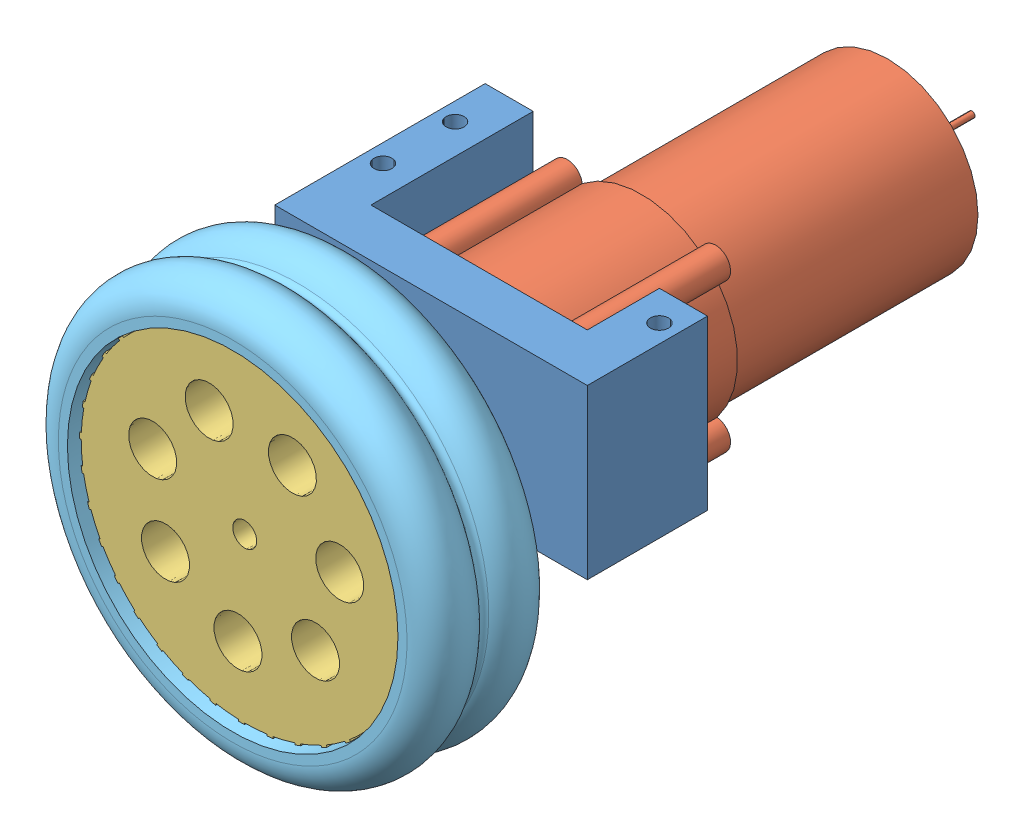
SolidWorks assembly 电机装配2.SLDASM, configuration 默认 (file format 9000). Lengths in mm.
Overall size (68 68 123).
5 component instances, 5 part files, 9 mates.
Components (placement in the parent):
- 电机座 - 副本-1: 电机座 - 副本.SLDPRT [默认] at (2.147 -4.337 52) size (52 28 35)
- 冯哈勃电机-1: 冯哈勃电机.SLDPRT [默认] at (2.147 -9.2748 17) x (0 1 0) z (1 0 0) size (32 110 32)
- 3D打印轮子 - 副本-1: 3D打印轮子 - 副本.SLDPRT [默认] at (2.147 -9.2748 68) x (0.98812 0.153684 0) z (0 0 1) size (56.8 56.8 15)
- 联轴器-1: 联轴器.SLDPRT [默认] at (2.147 -9.2748 78) x (-0.923728 -0.383049 0) z (0 0 -1) size (13.86 12 18)
- 4轮子 - 副本-1: 4轮子 - 副本.SLDPRT [默认] at (2.147 -9.2748 75) size (68 68 20)
Mates (geometry in assembly coordinates):
- 同心1: concentric anti-aligned: cylinder of 电机座 - 副本-1 through (2.147 -9.2748 44) axis (0 0 1) radius 8.5; cylinder of 冯哈勃电机-1 through (2.147 -9.2748 46.4) axis (0 0 -1) radius 8
- 同心2: concentric aligned: cylinder of 电机座 - 副本-1 through (2.147 2.8495 60) axis (0 0 -1) radius 1.5; cylinder of 冯哈勃电机-1 through (2.147 2.8495 44) axis (0 0 -1) radius 1.5
- 同心3: concentric aligned: cylinder of 冯哈勃电机-1 through (2.147 -9.2748 72) axis (0 0 -1) radius 3; cylinder of 3D打印轮子 - 副本-1 through (2.147 -9.2748 89) axis (0 0 -1) radius 2
- 同心4: concentric aligned: cylinder of 冯哈勃电机-1 through (2.147 -9.2748 72) axis (0 0 -1) radius 3; cylinder of 联轴器-1 through (2.147 -9.2748 72) axis (0 0 -1) radius 3
- 重合3: coincident anti-aligned: plane of 冯哈勃电机-1 through (2.147 -9.2748 72) normal (0 0 1); plane of 联轴器-1 through (2.147 -9.2748 72) normal (0 0 -1)
- 重合4: coincident anti-aligned: plane of 3D打印轮子 - 副本-1 through (2.147 -9.2748 78) normal (0 0 -1); plane of 联轴器-1 through (2.147 -9.2748 78) normal (0 0 1)
- 同心5: concentric anti-aligned: cylinder of 3D打印轮子 - 副本-1 through (2.147 -9.2748 65.8081) axis (0 0 1) radius 28.4; cylinder of 4轮子 - 副本-1 through (2.147 -9.2748 120) axis (0 0 -1) radius 27.5
- 距离1: distance = 2 mm aligned: plane of 4轮子 - 副本-1 through (27.147 -9.2748 85) normal (0 0 1); plane of 3D打印轮子 - 副本-1 through (2.147 -9.2748 83) normal (0 0 1)
- 重合5: coincident anti-aligned: plane of 电机座 - 副本-1 through (2.147 -4.337 44) normal (0 0 -1); plane of 冯哈勃电机-1 through (2.147 -9.2748 44) normal (0 0 1)
